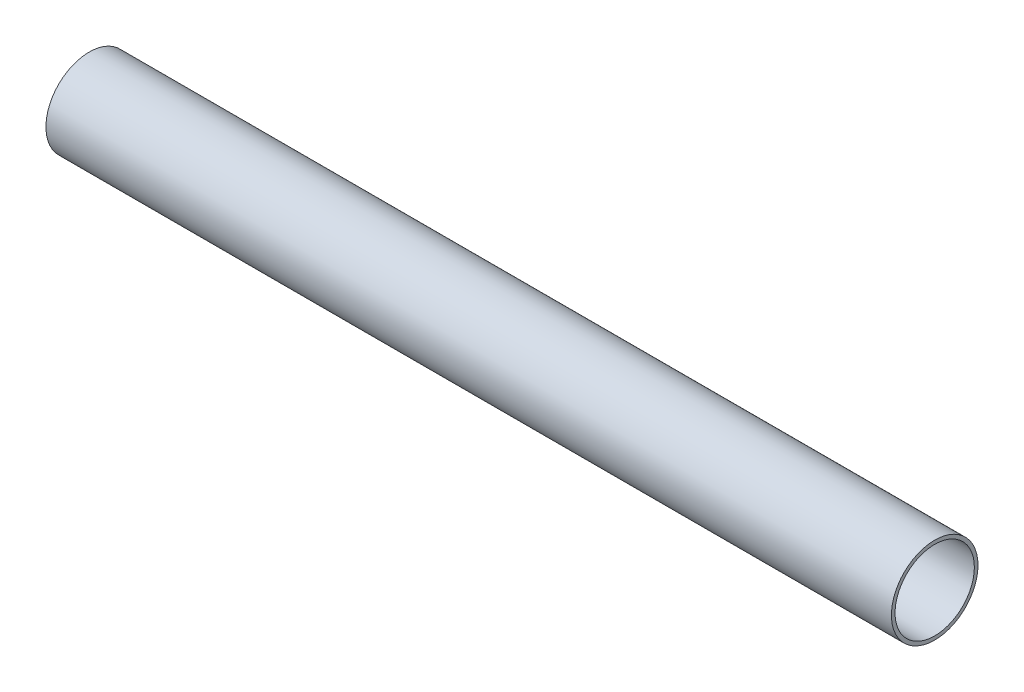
from build123d import *

# Parameters (mm, degrees)
ESQUISSE2_R   = 38.05
ESQUISSE2_R_2 = 34.85


with BuildPart() as part:
    # Balayage-Mince3: sweep along a path in Esquisse1
    with BuildLine(Plane.XY) as balayage_mince3_path:
        Line((0, 0), (743, 0))
    # Esquisse2 → Balayage-Mince3 (sweep)
    with BuildSketch(Plane(origin=(743, 0, 0), x_dir=(0, 0, -1), z_dir=(1, 0, 0))):
        Circle(ESQUISSE2_R)
        Circle(ESQUISSE2_R_2, mode=Mode.SUBTRACT)
    sweep(path=balayage_mince3_path.line)


solid = part.part
